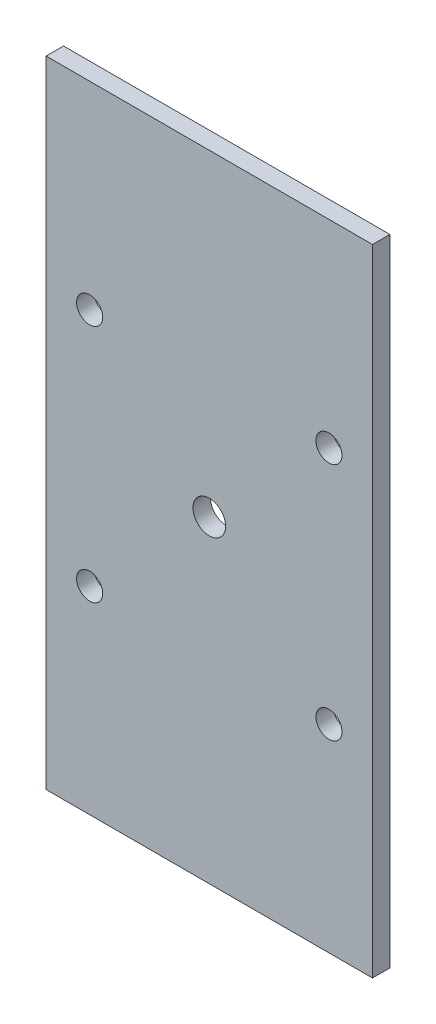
from build123d import *

# Parameters (mm, degrees)
SKETCH1_W           = 292
SKETCH1_H           = 150
BOSS_EXTRUDE1_DEPTH = 8
SKETCH2_R           = 6
CUT_EXTRUDE1_DEPTH  = 165.331981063
SKETCH3_R           = 7.5
CUT_EXTRUDE2_DEPTH  = 165.331981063


with BuildPart() as part:
    # Sketch1 → Boss-Extrude1 (new body)
    with BuildSketch(Plane(origin=(0, 0, 0), x_dir=(0, 1, 0), z_dir=(0, 0, 1))):
        Rectangle(SKETCH1_W, SKETCH1_H)
    extrude(amount=BOSS_EXTRUDE1_DEPTH)

    # Sketch2 → Cut-Extrude1 (cut, through all)
    with BuildSketch(Plane.XY.offset(8)):
        with Locations((-55, 55)):
            Circle(SKETCH2_R)
        with Locations((55, 55)):
            Circle(SKETCH2_R)
        with Locations((-55, -55)):
            Circle(SKETCH2_R)
        with Locations((55, -55)):
            Circle(SKETCH2_R)
    extrude(amount=-CUT_EXTRUDE1_DEPTH, mode=Mode.SUBTRACT)

    # Sketch3 → Cut-Extrude2 (cut, through all)
    with BuildSketch(Plane(origin=(0, 0, 0), x_dir=(0, 1, 0), z_dir=(0, 0, 1))):
        with Locations(Location((0, 0, 0), (0, 0, 270))):
            Circle(SKETCH3_R)
    extrude(amount=CUT_EXTRUDE2_DEPTH, mode=Mode.SUBTRACT)


solid = part.part
